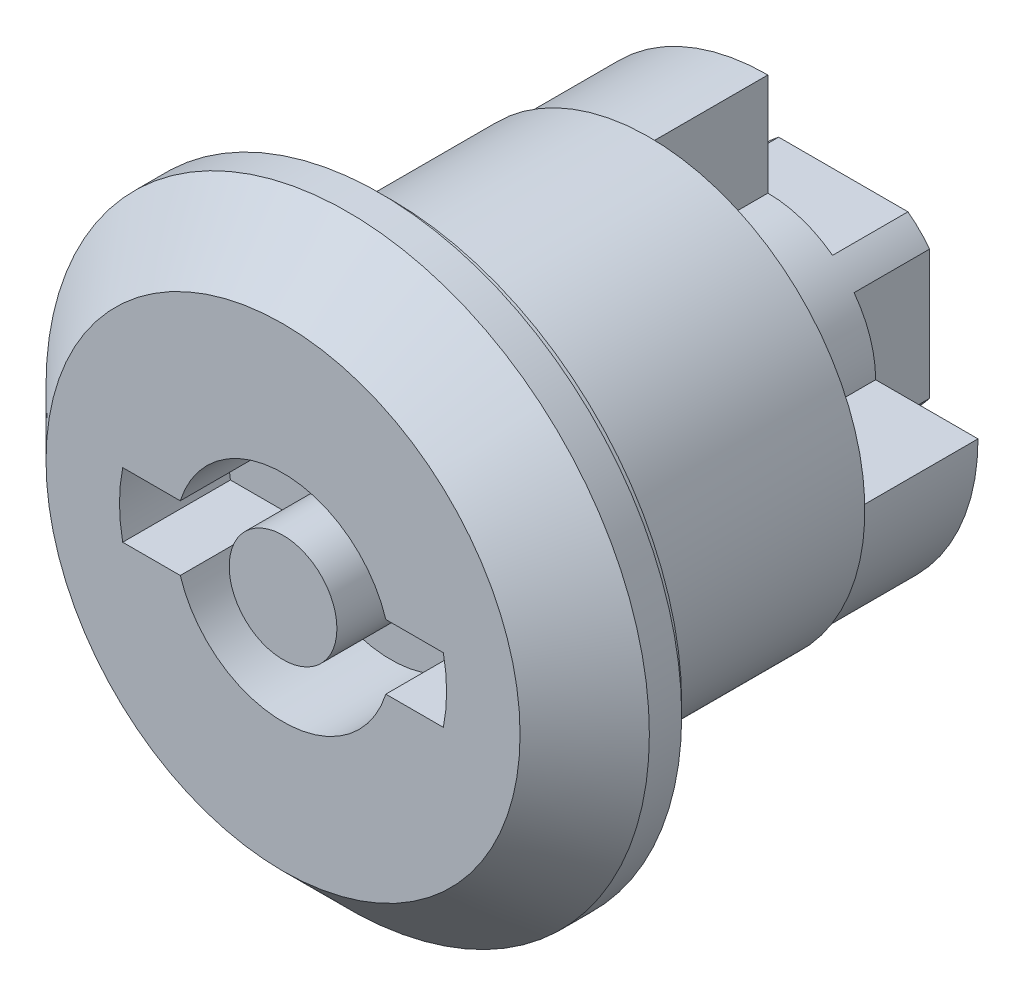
ISO-10303-21;
HEADER;
FILE_DESCRIPTION(('STEP AP214'),'2;1');
FILE_NAME('part.step','',(''),(''),'','','');
FILE_SCHEMA(('AUTOMOTIVE_DESIGN { 1 0 10303 214 1 1 1 1 }'));
ENDSEC;
DATA;
#1=APPLICATION_CONTEXT('core data for automotive mechanical design processes');
#2=APPLICATION_PROTOCOL_DEFINITION('international standard','automotive_design',2000,#1);
#3=PRODUCT_CONTEXT('',#1,'mechanical');
#4=PRODUCT('Part','Part','',(#3));
#5=PRODUCT_RELATED_PRODUCT_CATEGORY('part','',(#4));
#6=PRODUCT_DEFINITION_FORMATION('','',#4);
#7=PRODUCT_DEFINITION_CONTEXT('part definition',#1,'design');
#8=PRODUCT_DEFINITION('design','',#6,#7);
#9=PRODUCT_DEFINITION_SHAPE('','',#8);
#10=(LENGTH_UNIT() NAMED_UNIT(*) SI_UNIT(.MILLI.,.METRE.));
#11=(NAMED_UNIT(*) PLANE_ANGLE_UNIT() SI_UNIT($,.RADIAN.));
#12=(NAMED_UNIT(*) SI_UNIT($,.STERADIAN.) SOLID_ANGLE_UNIT());
#13=UNCERTAINTY_MEASURE_WITH_UNIT(LENGTH_MEASURE(1.E-05),#10,'distance_accuracy_value','');
#14=(GEOMETRIC_REPRESENTATION_CONTEXT(3) GLOBAL_UNCERTAINTY_ASSIGNED_CONTEXT((#13)) GLOBAL_UNIT_ASSIGNED_CONTEXT((#10,
#11,#12)) REPRESENTATION_CONTEXT('',''));
#15=CARTESIAN_POINT('',(0.,0.,0.));
#16=DIRECTION('',(0.,0.,1.));
#17=DIRECTION('',(1.,0.,0.));
#18=AXIS2_PLACEMENT_3D('',#15,#16,#17);
#19=CARTESIAN_POINT('',(0.,0.,-50.));
#20=DIRECTION('',(0.,0.,-1.));
#21=DIRECTION('',(-1.,0.,0.));
#22=AXIS2_PLACEMENT_3D('',#19,#20,#21);
#23=CYLINDRICAL_SURFACE('',#22,5.);
#24=CARTESIAN_POINT('',(0.,0.,-17.5));
#25=DIRECTION('',(0.,0.,-1.));
#26=DIRECTION('',(-1.,0.,0.));
#27=AXIS2_PLACEMENT_3D('',#24,#25,#26);
#28=CIRCLE('',#27,5.);
#29=CARTESIAN_POINT('',(-4.,3.,-17.5));
#30=VERTEX_POINT('',#29);
#31=CARTESIAN_POINT('',(-3.,4.,-17.5));
#32=VERTEX_POINT('',#31);
#33=EDGE_CURVE('E271',#30,#32,#28,.T.);
#34=ORIENTED_EDGE('',*,*,#33,.T.);
#35=DIRECTION('',(0.,0.,-1.));
#36=VECTOR('',#35,1.);
#37=CARTESIAN_POINT('',(-3.,4.,-11.4172374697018));
#38=LINE('',#37,#36);
#39=CARTESIAN_POINT('',(-3.,4.,-21.));
#40=VERTEX_POINT('',#39);
#41=EDGE_CURVE('E291',#32,#40,#38,.T.);
#42=ORIENTED_EDGE('',*,*,#41,.T.);
#43=CARTESIAN_POINT('',(0.,0.,-21.));
#44=DIRECTION('',(0.,0.,-1.));
#45=DIRECTION('',(-1.,0.,0.));
#46=AXIS2_PLACEMENT_3D('',#43,#44,#45);
#47=CIRCLE('',#46,5.);
#48=CARTESIAN_POINT('',(-4.,3.,-21.));
#49=VERTEX_POINT('',#48);
#50=EDGE_CURVE('E275',#49,#40,#47,.T.);
#51=ORIENTED_EDGE('',*,*,#50,.F.);
#52=DIRECTION('',(0.,0.,-1.));
#53=VECTOR('',#52,1.);
#54=CARTESIAN_POINT('',(-4.,3.,-11.4172374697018));
#55=LINE('',#54,#53);
#56=EDGE_CURVE('E288',#30,#49,#55,.T.);
#57=ORIENTED_EDGE('',*,*,#56,.F.);
#58=EDGE_LOOP('',(#34,#42,#51,#57));
#59=FACE_BOUND('',#58,.T.);
#60=ADVANCED_FACE('F14',(#59),#23,.T.);
#61=DIRECTION('',(0.,0.,-1.));
#62=VECTOR('',#61,1.);
#63=CARTESIAN_POINT('',(-3.,-4.,-11.4172374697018));
#64=LINE('',#63,#62);
#65=CARTESIAN_POINT('',(-3.,-4.,-17.5));
#66=VERTEX_POINT('',#65);
#67=CARTESIAN_POINT('',(-3.,-4.,-21.));
#68=VERTEX_POINT('',#67);
#69=EDGE_CURVE('E262',#66,#68,#64,.T.);
#70=ORIENTED_EDGE('',*,*,#69,.F.);
#71=CARTESIAN_POINT('',(-4.,-3.,-17.5));
#72=VERTEX_POINT('',#71);
#73=EDGE_CURVE('E276',#66,#72,#28,.T.);
#74=ORIENTED_EDGE('',*,*,#73,.T.);
#75=DIRECTION('',(0.,0.,-1.));
#76=VECTOR('',#75,1.);
#77=CARTESIAN_POINT('',(-4.,-3.,-11.4172374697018));
#78=LINE('',#77,#76);
#79=CARTESIAN_POINT('',(-4.,-3.,-21.));
#80=VERTEX_POINT('',#79);
#81=EDGE_CURVE('E309',#72,#80,#78,.T.);
#82=ORIENTED_EDGE('',*,*,#81,.T.);
#83=EDGE_CURVE('E272',#68,#80,#47,.T.);
#84=ORIENTED_EDGE('',*,*,#83,.F.);
#85=EDGE_LOOP('',(#70,#74,#82,#84));
#86=FACE_BOUND('',#85,.T.);
#87=ADVANCED_FACE('F220',(#86),#23,.T.);
#88=DIRECTION('',(0.,0.,-1.));
#89=VECTOR('',#88,1.);
#90=CARTESIAN_POINT('',(3.,-4.,-11.4172374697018));
#91=LINE('',#90,#89);
#92=CARTESIAN_POINT('',(3.,-4.,-17.5));
#93=VERTEX_POINT('',#92);
#94=CARTESIAN_POINT('',(3.,-4.,-21.));
#95=VERTEX_POINT('',#94);
#96=EDGE_CURVE('E254',#93,#95,#91,.T.);
#97=ORIENTED_EDGE('',*,*,#96,.T.);
#98=CARTESIAN_POINT('',(4.,-3.,-21.));
#99=VERTEX_POINT('',#98);
#100=EDGE_CURVE('E257',#99,#95,#47,.T.);
#101=ORIENTED_EDGE('',*,*,#100,.F.);
#102=DIRECTION('',(0.,0.,-1.));
#103=VECTOR('',#102,1.);
#104=CARTESIAN_POINT('',(4.,-3.,-11.4172374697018));
#105=LINE('',#104,#103);
#106=CARTESIAN_POINT('',(4.,-3.,-17.5));
#107=VERTEX_POINT('',#106);
#108=EDGE_CURVE('E313',#107,#99,#105,.T.);
#109=ORIENTED_EDGE('',*,*,#108,.F.);
#110=EDGE_CURVE('E259',#107,#93,#28,.T.);
#111=ORIENTED_EDGE('',*,*,#110,.T.);
#112=EDGE_LOOP('',(#97,#101,#109,#111));
#113=FACE_BOUND('',#112,.T.);
#114=ADVANCED_FACE('F228',(#113),#23,.T.);
#115=CARTESIAN_POINT('',(0.,5.,-21.));
#116=DIRECTION('',(0.,0.,1.));
#117=DIRECTION('',(1.,0.,0.));
#118=AXIS2_PLACEMENT_3D('',#115,#116,#117);
#119=PLANE('',#118);
#120=CARTESIAN_POINT('',(0.,0.,-21.));
#121=DIRECTION('',(0.,0.,-1.));
#122=DIRECTION('',(-1.,0.,0.));
#123=AXIS2_PLACEMENT_3D('',#120,#121,#122);
#124=CIRCLE('',#123,3.);
#125=CARTESIAN_POINT('',(-3.,0.,-21.));
#126=VERTEX_POINT('',#125);
#127=EDGE_CURVE('E441',#126,#126,#124,.T.);
#128=ORIENTED_EDGE('',*,*,#127,.F.);
#129=EDGE_LOOP('',(#128));
#130=FACE_BOUND('',#129,.T.);
#131=ORIENTED_EDGE('',*,*,#50,.T.);
#132=DIRECTION('',(-1.,0.,0.));
#133=VECTOR('',#132,1.);
#134=CARTESIAN_POINT('',(3.,4.,-21.));
#135=LINE('',#134,#133);
#136=CARTESIAN_POINT('',(3.,4.,-21.));
#137=VERTEX_POINT('',#136);
#138=EDGE_CURVE('E283',#137,#40,#135,.T.);
#139=ORIENTED_EDGE('',*,*,#138,.F.);
#140=CARTESIAN_POINT('',(4.,3.,-21.));
#141=VERTEX_POINT('',#140);
#142=EDGE_CURVE('E274',#137,#141,#47,.T.);
#143=ORIENTED_EDGE('',*,*,#142,.T.);
#144=DIRECTION('',(0.,-1.,0.));
#145=VECTOR('',#144,1.);
#146=CARTESIAN_POINT('',(4.,3.,-21.));
#147=LINE('',#146,#145);
#148=EDGE_CURVE('E270',#141,#99,#147,.T.);
#149=ORIENTED_EDGE('',*,*,#148,.T.);
#150=ORIENTED_EDGE('',*,*,#100,.T.);
#151=DIRECTION('',(-1.,0.,0.));
#152=VECTOR('',#151,1.);
#153=CARTESIAN_POINT('',(3.,-4.,-21.));
#154=LINE('',#153,#152);
#155=EDGE_CURVE('E261',#95,#68,#154,.T.);
#156=ORIENTED_EDGE('',*,*,#155,.T.);
#157=ORIENTED_EDGE('',*,*,#83,.T.);
#158=DIRECTION('',(0.,-1.,0.));
#159=VECTOR('',#158,1.);
#160=CARTESIAN_POINT('',(-4.,3.,-21.));
#161=LINE('',#160,#159);
#162=EDGE_CURVE('E285',#49,#80,#161,.T.);
#163=ORIENTED_EDGE('',*,*,#162,.F.);
#164=EDGE_LOOP('',(#131,#139,#143,#149,#150,#156,#157,#163));
#165=FACE_BOUND('',#164,.T.);
#166=ADVANCED_FACE('F234',(#130,#165),#119,.F.);
#167=ORIENTED_EDGE('',*,*,#142,.F.);
#168=DIRECTION('',(0.,0.,-1.));
#169=VECTOR('',#168,1.);
#170=CARTESIAN_POINT('',(3.,4.,-11.4172374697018));
#171=LINE('',#170,#169);
#172=CARTESIAN_POINT('',(3.,4.,-17.5));
#173=VERTEX_POINT('',#172);
#174=EDGE_CURVE('E294',#173,#137,#171,.T.);
#175=ORIENTED_EDGE('',*,*,#174,.F.);
#176=CARTESIAN_POINT('',(0.,0.,-17.5));
#177=DIRECTION('',(0.,0.,-1.));
#178=DIRECTION('',(-1.,0.,0.));
#179=AXIS2_PLACEMENT_3D('',#176,#177,#178);
#180=CIRCLE('',#179,5.);
#181=CARTESIAN_POINT('',(0.,5.,-17.5));
#182=VERTEX_POINT('',#181);
#183=EDGE_CURVE('E451',#182,#173,#180,.T.);
#184=ORIENTED_EDGE('',*,*,#183,.F.);
#185=DIRECTION('',(0.,0.,-1.));
#186=VECTOR('',#185,1.);
#187=CARTESIAN_POINT('',(0.,5.,1.78858223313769));
#188=LINE('',#187,#186);
#189=CARTESIAN_POINT('',(0.,5.,-12.));
#190=VERTEX_POINT('',#189);
#191=EDGE_CURVE('E465',#190,#182,#188,.T.);
#192=ORIENTED_EDGE('',*,*,#191,.F.);
#193=CARTESIAN_POINT('',(0.,0.,-12.));
#194=DIRECTION('',(0.,0.,1.));
#195=DIRECTION('',(1.,0.,0.));
#196=AXIS2_PLACEMENT_3D('',#193,#194,#195);
#197=CIRCLE('',#196,5.);
#198=CARTESIAN_POINT('',(5.,0.,-12.));
#199=VERTEX_POINT('',#198);
#200=EDGE_CURVE('E449',#190,#199,#197,.F.);
#201=ORIENTED_EDGE('',*,*,#200,.T.);
#202=DIRECTION('',(0.,0.,-1.));
#203=VECTOR('',#202,1.);
#204=CARTESIAN_POINT('',(5.,0.,1.78858223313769));
#205=LINE('',#204,#203);
#206=CARTESIAN_POINT('',(5.,0.,-17.5));
#207=VERTEX_POINT('',#206);
#208=EDGE_CURVE('E453',#199,#207,#205,.T.);
#209=ORIENTED_EDGE('',*,*,#208,.T.);
#210=CARTESIAN_POINT('',(4.,3.,-17.5));
#211=VERTEX_POINT('',#210);
#212=EDGE_CURVE('E454',#211,#207,#180,.T.);
#213=ORIENTED_EDGE('',*,*,#212,.F.);
#214=DIRECTION('',(0.,0.,-1.));
#215=VECTOR('',#214,1.);
#216=CARTESIAN_POINT('',(4.,3.,-11.4172374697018));
#217=LINE('',#216,#215);
#218=EDGE_CURVE('E316',#211,#141,#217,.T.);
#219=ORIENTED_EDGE('',*,*,#218,.T.);
#220=EDGE_LOOP('',(#167,#175,#184,#192,#201,#209,#213,#219));
#221=FACE_BOUND('',#220,.T.);
#222=ADVANCED_FACE('F223',(#221),#23,.T.);
#223=CARTESIAN_POINT('',(0.,0.,-50.));
#224=DIRECTION('',(0.,0.,-1.));
#225=DIRECTION('',(-1.,0.,0.));
#226=AXIS2_PLACEMENT_3D('',#223,#224,#225);
#227=CYLINDRICAL_SURFACE('',#226,10.);
#228=CARTESIAN_POINT('',(0.,0.,-12.));
#229=DIRECTION('',(0.,0.,-1.));
#230=DIRECTION('',(-1.,0.,0.));
#231=AXIS2_PLACEMENT_3D('',#228,#229,#230);
#232=CIRCLE('',#231,10.);
#233=CARTESIAN_POINT('',(-10.,0.,-12.));
#234=VERTEX_POINT('',#233);
#235=EDGE_CURVE('E9',#234,#234,#232,.T.);
#236=ORIENTED_EDGE('',*,*,#235,.F.);
#237=EDGE_LOOP('',(#236));
#238=FACE_BOUND('',#237,.T.);
#239=CARTESIAN_POINT('',(0.,0.,0.));
#240=DIRECTION('',(0.,0.,-1.));
#241=DIRECTION('',(-1.,0.,0.));
#242=AXIS2_PLACEMENT_3D('',#239,#240,#241);
#243=CIRCLE('',#242,10.);
#244=CARTESIAN_POINT('',(-10.,0.,0.));
#245=VERTEX_POINT('',#244);
#246=EDGE_CURVE('E318',#245,#245,#243,.T.);
#247=ORIENTED_EDGE('',*,*,#246,.T.);
#248=EDGE_LOOP('',(#247));
#249=FACE_BOUND('',#248,.T.);
#250=ADVANCED_FACE('F16',(#238,#249),#227,.T.);
#251=CARTESIAN_POINT('',(0.,10.,-12.));
#252=DIRECTION('',(0.,0.,1.));
#253=DIRECTION('',(1.,0.,0.));
#254=AXIS2_PLACEMENT_3D('',#251,#252,#253);
#255=PLANE('',#254);
#256=CARTESIAN_POINT('',(0.,0.,-12.));
#257=DIRECTION('',(0.,0.,-1.));
#258=DIRECTION('',(-1.,0.,0.));
#259=AXIS2_PLACEMENT_3D('',#256,#257,#258);
#260=CIRCLE('',#259,9.75);
#261=CARTESIAN_POINT('',(9.75,0.,-12.));
#262=VERTEX_POINT('',#261);
#263=CARTESIAN_POINT('',(0.,9.75,-12.));
#264=VERTEX_POINT('',#263);
#265=EDGE_CURVE('E22',#262,#264,#260,.T.);
#266=ORIENTED_EDGE('',*,*,#265,.F.);
#267=DIRECTION('',(1.,0.,0.));
#268=VECTOR('',#267,1.);
#269=CARTESIAN_POINT('',(5.,0.,-12.));
#270=LINE('',#269,#268);
#271=EDGE_CURVE('E458',#199,#262,#270,.T.);
#272=ORIENTED_EDGE('',*,*,#271,.F.);
#273=ORIENTED_EDGE('',*,*,#200,.F.);
#274=DIRECTION('',(0.,1.,0.));
#275=VECTOR('',#274,1.);
#276=CARTESIAN_POINT('',(0.,5.,-12.));
#277=LINE('',#276,#275);
#278=EDGE_CURVE('E459',#190,#264,#277,.T.);
#279=ORIENTED_EDGE('',*,*,#278,.T.);
#280=EDGE_LOOP('',(#266,#272,#273,#279));
#281=FACE_BOUND('',#280,.T.);
#282=ORIENTED_EDGE('',*,*,#235,.T.);
#283=EDGE_LOOP('',(#282));
#284=FACE_BOUND('',#283,.T.);
#285=ADVANCED_FACE('F241',(#281,#284),#255,.F.);
#286=CARTESIAN_POINT('',(0.,0.,-50.));
#287=DIRECTION('',(0.,0.,-1.));
#288=DIRECTION('',(-1.,0.,0.));
#289=AXIS2_PLACEMENT_3D('',#286,#287,#288);
#290=CYLINDRICAL_SURFACE('',#289,9.75);
#291=ORIENTED_EDGE('',*,*,#265,.T.);
#292=DIRECTION('',(0.,0.,-1.));
#293=VECTOR('',#292,1.);
#294=CARTESIAN_POINT('',(0.,9.75,1.78858223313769));
#295=LINE('',#294,#293);
#296=CARTESIAN_POINT('',(0.,9.75,-17.5));
#297=VERTEX_POINT('',#296);
#298=EDGE_CURVE('E461',#264,#297,#295,.T.);
#299=ORIENTED_EDGE('',*,*,#298,.T.);
#300=CARTESIAN_POINT('',(0.,0.,-17.5));
#301=DIRECTION('',(0.,0.,-1.));
#302=DIRECTION('',(-1.,0.,0.));
#303=AXIS2_PLACEMENT_3D('',#300,#301,#302);
#304=CIRCLE('',#303,9.75);
#305=CARTESIAN_POINT('',(9.75,0.,-17.5));
#306=VERTEX_POINT('',#305);
#307=EDGE_CURVE('E477',#306,#297,#304,.T.);
#308=ORIENTED_EDGE('',*,*,#307,.F.);
#309=DIRECTION('',(0.,0.,-1.));
#310=VECTOR('',#309,1.);
#311=CARTESIAN_POINT('',(9.75,0.,1.78858223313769));
#312=LINE('',#311,#310);
#313=EDGE_CURVE('E37',#262,#306,#312,.T.);
#314=ORIENTED_EDGE('',*,*,#313,.F.);
#315=EDGE_LOOP('',(#291,#299,#308,#314));
#316=FACE_BOUND('',#315,.T.);
#317=ADVANCED_FACE('F349',(#316),#290,.T.);
#318=CARTESIAN_POINT('',(0.,9.75,-17.5));
#319=DIRECTION('',(0.,0.,1.));
#320=DIRECTION('',(1.,0.,0.));
#321=AXIS2_PLACEMENT_3D('',#318,#319,#320);
#322=PLANE('',#321);
#323=ORIENTED_EDGE('',*,*,#307,.T.);
#324=DIRECTION('',(0.,1.,0.));
#325=VECTOR('',#324,1.);
#326=CARTESIAN_POINT('',(0.,5.,-17.5));
#327=LINE('',#326,#325);
#328=EDGE_CURVE('E447',#182,#297,#327,.T.);
#329=ORIENTED_EDGE('',*,*,#328,.F.);
#330=ORIENTED_EDGE('',*,*,#183,.T.);
#331=DIRECTION('',(-1.,0.,0.));
#332=VECTOR('',#331,1.);
#333=CARTESIAN_POINT('',(3.,4.,-17.5));
#334=LINE('',#333,#332);
#335=EDGE_CURVE('E295',#173,#32,#334,.T.);
#336=ORIENTED_EDGE('',*,*,#335,.T.);
#337=ORIENTED_EDGE('',*,*,#33,.F.);
#338=DIRECTION('',(0.,-1.,0.));
#339=VECTOR('',#338,1.);
#340=CARTESIAN_POINT('',(-4.,3.,-17.5));
#341=LINE('',#340,#339);
#342=EDGE_CURVE('E306',#30,#72,#341,.T.);
#343=ORIENTED_EDGE('',*,*,#342,.T.);
#344=ORIENTED_EDGE('',*,*,#73,.F.);
#345=DIRECTION('',(-1.,0.,0.));
#346=VECTOR('',#345,1.);
#347=CARTESIAN_POINT('',(3.,-4.,-17.5));
#348=LINE('',#347,#346);
#349=EDGE_CURVE('E302',#93,#66,#348,.T.);
#350=ORIENTED_EDGE('',*,*,#349,.F.);
#351=ORIENTED_EDGE('',*,*,#110,.F.);
#352=DIRECTION('',(0.,-1.,0.));
#353=VECTOR('',#352,1.);
#354=CARTESIAN_POINT('',(4.,3.,-17.5));
#355=LINE('',#354,#353);
#356=EDGE_CURVE('E315',#211,#107,#355,.T.);
#357=ORIENTED_EDGE('',*,*,#356,.F.);
#358=ORIENTED_EDGE('',*,*,#212,.T.);
#359=DIRECTION('',(1.,0.,0.));
#360=VECTOR('',#359,1.);
#361=CARTESIAN_POINT('',(5.,0.,-17.5));
#362=LINE('',#361,#360);
#363=EDGE_CURVE('E450',#207,#306,#362,.T.);
#364=ORIENTED_EDGE('',*,*,#363,.T.);
#365=EDGE_LOOP('',(#323,#329,#330,#336,#337,#343,#344,#350,#351,#357,#358,#364));
#366=FACE_BOUND('',#365,.T.);
#367=ADVANCED_FACE('F340',(#366),#322,.F.);
#368=CARTESIAN_POINT('',(0.,11.,5.));
#369=DIRECTION('',(0.,0.,1.));
#370=DIRECTION('',(1.,0.,0.));
#371=AXIS2_PLACEMENT_3D('',#368,#369,#370);
#372=PLANE('',#371);
#373=CARTESIAN_POINT('',(0.,0.,5.));
#374=DIRECTION('',(0.,0.,1.));
#375=DIRECTION('',(1.,0.,0.));
#376=AXIS2_PLACEMENT_3D('',#373,#374,#375);
#377=CIRCLE('',#376,7.59);
#378=CARTESIAN_POINT('',(-7.44030241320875,1.5,5.));
#379=VERTEX_POINT('',#378);
#380=CARTESIAN_POINT('',(-7.44030241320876,-1.5,5.));
#381=VERTEX_POINT('',#380);
#382=EDGE_CURVE('E29',#379,#381,#377,.T.);
#383=ORIENTED_EDGE('',*,*,#382,.F.);
#384=DIRECTION('',(1.,0.,0.));
#385=VECTOR('',#384,1.);
#386=CARTESIAN_POINT('',(-7.44030241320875,1.5,5.));
#387=LINE('',#386,#385);
#388=CARTESIAN_POINT('',(-4.76969600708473,1.5,5.));
#389=VERTEX_POINT('',#388);
#390=EDGE_CURVE('E183',#379,#389,#387,.T.);
#391=ORIENTED_EDGE('',*,*,#390,.T.);
#392=CARTESIAN_POINT('',(0.,0.,5.));
#393=DIRECTION('',(0.,0.,1.));
#394=DIRECTION('',(1.,0.,0.));
#395=AXIS2_PLACEMENT_3D('',#392,#393,#394);
#396=CIRCLE('',#395,5.);
#397=CARTESIAN_POINT('',(4.76969600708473,1.5,5.));
#398=VERTEX_POINT('',#397);
#399=EDGE_CURVE('E177',#398,#389,#396,.T.);
#400=ORIENTED_EDGE('',*,*,#399,.F.);
#401=DIRECTION('',(1.,0.,0.));
#402=VECTOR('',#401,1.);
#403=CARTESIAN_POINT('',(4.76969600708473,1.5,5.));
#404=LINE('',#403,#402);
#405=CARTESIAN_POINT('',(7.44030241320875,1.5,5.));
#406=VERTEX_POINT('',#405);
#407=EDGE_CURVE('E184',#398,#406,#404,.T.);
#408=ORIENTED_EDGE('',*,*,#407,.T.);
#409=CARTESIAN_POINT('',(7.44030241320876,-1.5,5.));
#410=VERTEX_POINT('',#409);
#411=EDGE_CURVE('E178',#410,#406,#377,.T.);
#412=ORIENTED_EDGE('',*,*,#411,.F.);
#413=DIRECTION('',(-1.,0.,0.));
#414=VECTOR('',#413,1.);
#415=CARTESIAN_POINT('',(7.44030241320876,-1.5,5.));
#416=LINE('',#415,#414);
#417=CARTESIAN_POINT('',(4.76969600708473,-1.5,5.));
#418=VERTEX_POINT('',#417);
#419=EDGE_CURVE('E175',#410,#418,#416,.T.);
#420=ORIENTED_EDGE('',*,*,#419,.T.);
#421=CARTESIAN_POINT('',(-4.76969600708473,-1.5,5.));
#422=VERTEX_POINT('',#421);
#423=EDGE_CURVE('E156',#422,#418,#396,.T.);
#424=ORIENTED_EDGE('',*,*,#423,.F.);
#425=DIRECTION('',(-1.,0.,0.));
#426=VECTOR('',#425,1.);
#427=CARTESIAN_POINT('',(-4.76969600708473,-1.5,5.));
#428=LINE('',#427,#426);
#429=EDGE_CURVE('E167',#422,#381,#428,.T.);
#430=ORIENTED_EDGE('',*,*,#429,.T.);
#431=EDGE_LOOP('',(#383,#391,#400,#408,#412,#420,#424,#430));
#432=FACE_BOUND('',#431,.T.);
#433=CARTESIAN_POINT('',(0.,0.,5.));
#434=DIRECTION('',(0.,0.,-1.));
#435=DIRECTION('',(-1.,0.,0.));
#436=AXIS2_PLACEMENT_3D('',#433,#434,#435);
#437=CIRCLE('',#436,11.);
#438=CARTESIAN_POINT('',(-11.,0.,5.));
#439=VERTEX_POINT('',#438);
#440=EDGE_CURVE('E279',#439,#439,#437,.T.);
#441=ORIENTED_EDGE('',*,*,#440,.F.);
#442=EDGE_LOOP('',(#441));
#443=FACE_BOUND('',#442,.T.);
#444=ADVANCED_FACE('F171',(#432,#443),#372,.T.);
#445=CARTESIAN_POINT('',(0.,0.,5.));
#446=DIRECTION('',(0.,0.,-1.));
#447=DIRECTION('',(-1.,0.,0.));
#448=AXIS2_PLACEMENT_3D('',#445,#446,#447);
#449=CONICAL_SURFACE('',#448,11.,0.785398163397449);
#450=CARTESIAN_POINT('',(0.,0.,2.));
#451=DIRECTION('',(0.,0.,-1.));
#452=DIRECTION('',(-1.,0.,0.));
#453=AXIS2_PLACEMENT_3D('',#450,#451,#452);
#454=CIRCLE('',#453,14.);
#455=CARTESIAN_POINT('',(-14.,0.,2.));
#456=VERTEX_POINT('',#455);
#457=EDGE_CURVE('E333',#456,#456,#454,.T.);
#458=ORIENTED_EDGE('',*,*,#457,.F.);
#459=EDGE_LOOP('',(#458));
#460=FACE_BOUND('',#459,.T.);
#461=ORIENTED_EDGE('',*,*,#440,.T.);
#462=EDGE_LOOP('',(#461));
#463=FACE_BOUND('',#462,.T.);
#464=ADVANCED_FACE('F338',(#460,#463),#449,.T.);
#465=CARTESIAN_POINT('',(0.,0.,-50.));
#466=DIRECTION('',(0.,0.,-1.));
#467=DIRECTION('',(-1.,0.,0.));
#468=AXIS2_PLACEMENT_3D('',#465,#466,#467);
#469=CYLINDRICAL_SURFACE('',#468,14.);
#470=CARTESIAN_POINT('',(0.,0.,0.500000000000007));
#471=DIRECTION('',(0.,0.,-1.));
#472=DIRECTION('',(-1.,0.,0.));
#473=AXIS2_PLACEMENT_3D('',#470,#471,#472);
#474=CIRCLE('',#473,14.);
#475=CARTESIAN_POINT('',(-14.,0.,0.500000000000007));
#476=VERTEX_POINT('',#475);
#477=EDGE_CURVE('E330',#476,#476,#474,.T.);
#478=ORIENTED_EDGE('',*,*,#477,.F.);
#479=EDGE_LOOP('',(#478));
#480=FACE_BOUND('',#479,.T.);
#481=ORIENTED_EDGE('',*,*,#457,.T.);
#482=EDGE_LOOP('',(#481));
#483=FACE_BOUND('',#482,.T.);
#484=ADVANCED_FACE('F346',(#480,#483),#469,.T.);
#485=CARTESIAN_POINT('',(0.,14.,0.50000000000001));
#486=DIRECTION('',(0.,0.,1.));
#487=DIRECTION('',(1.,0.,0.));
#488=AXIS2_PLACEMENT_3D('',#485,#486,#487);
#489=PLANE('',#488);
#490=CARTESIAN_POINT('',(0.,0.,0.500000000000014));
#491=DIRECTION('',(0.,0.,-1.));
#492=DIRECTION('',(-1.,0.,0.));
#493=AXIS2_PLACEMENT_3D('',#490,#491,#492);
#494=CIRCLE('',#493,13.5);
#495=CARTESIAN_POINT('',(-13.5,0.,0.500000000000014));
#496=VERTEX_POINT('',#495);
#497=EDGE_CURVE('E327',#496,#496,#494,.T.);
#498=ORIENTED_EDGE('',*,*,#497,.F.);
#499=EDGE_LOOP('',(#498));
#500=FACE_BOUND('',#499,.T.);
#501=ORIENTED_EDGE('',*,*,#477,.T.);
#502=EDGE_LOOP('',(#501));
#503=FACE_BOUND('',#502,.T.);
#504=ADVANCED_FACE('F354',(#500,#503),#489,.F.);
#505=CARTESIAN_POINT('',(0.,0.,-50.));
#506=DIRECTION('',(0.,0.,-1.));
#507=DIRECTION('',(-1.,0.,0.));
#508=AXIS2_PLACEMENT_3D('',#505,#506,#507);
#509=CYLINDRICAL_SURFACE('',#508,13.5);
#510=ORIENTED_EDGE('',*,*,#497,.T.);
#511=EDGE_LOOP('',(#510));
#512=FACE_BOUND('',#511,.T.);
#513=CARTESIAN_POINT('',(0.,0.,0.));
#514=DIRECTION('',(0.,0.,-1.));
#515=DIRECTION('',(-1.,0.,0.));
#516=AXIS2_PLACEMENT_3D('',#513,#514,#515);
#517=CIRCLE('',#516,13.5);
#518=CARTESIAN_POINT('',(-13.5,0.,0.));
#519=VERTEX_POINT('',#518);
#520=EDGE_CURVE('E324',#519,#519,#517,.T.);
#521=ORIENTED_EDGE('',*,*,#520,.F.);
#522=EDGE_LOOP('',(#521));
#523=FACE_BOUND('',#522,.T.);
#524=ADVANCED_FACE('F358',(#512,#523),#509,.T.);
#525=CARTESIAN_POINT('',(0.,13.5,0.));
#526=DIRECTION('',(0.,0.,1.));
#527=DIRECTION('',(1.,0.,0.));
#528=AXIS2_PLACEMENT_3D('',#525,#526,#527);
#529=PLANE('',#528);
#530=ORIENTED_EDGE('',*,*,#246,.F.);
#531=EDGE_LOOP('',(#530));
#532=FACE_BOUND('',#531,.T.);
#533=ORIENTED_EDGE('',*,*,#520,.T.);
#534=EDGE_LOOP('',(#533));
#535=FACE_BOUND('',#534,.T.);
#536=ADVANCED_FACE('F362',(#532,#535),#529,.F.);
#537=CARTESIAN_POINT('',(4.,3.,-11.4172374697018));
#538=DIRECTION('',(1.,0.,0.));
#539=DIRECTION('',(0.,0.,-1.));
#540=AXIS2_PLACEMENT_3D('',#537,#538,#539);
#541=PLANE('',#540);
#542=ORIENTED_EDGE('',*,*,#356,.T.);
#543=ORIENTED_EDGE('',*,*,#108,.T.);
#544=ORIENTED_EDGE('',*,*,#148,.F.);
#545=ORIENTED_EDGE('',*,*,#218,.F.);
#546=EDGE_LOOP('',(#542,#543,#544,#545));
#547=FACE_BOUND('',#546,.T.);
#548=ADVANCED_FACE('F366',(#547),#541,.T.);
#549=CARTESIAN_POINT('',(-4.,3.,-11.4172374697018));
#550=DIRECTION('',(1.,0.,0.));
#551=DIRECTION('',(0.,0.,-1.));
#552=AXIS2_PLACEMENT_3D('',#549,#550,#551);
#553=PLANE('',#552);
#554=ORIENTED_EDGE('',*,*,#56,.T.);
#555=ORIENTED_EDGE('',*,*,#162,.T.);
#556=ORIENTED_EDGE('',*,*,#81,.F.);
#557=ORIENTED_EDGE('',*,*,#342,.F.);
#558=EDGE_LOOP('',(#554,#555,#556,#557));
#559=FACE_BOUND('',#558,.T.);
#560=ADVANCED_FACE('F370',(#559),#553,.F.);
#561=CARTESIAN_POINT('',(3.,-4.,-11.4172374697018));
#562=DIRECTION('',(0.,-1.,0.));
#563=DIRECTION('',(1.,0.,0.));
#564=AXIS2_PLACEMENT_3D('',#561,#562,#563);
#565=PLANE('',#564);
#566=ORIENTED_EDGE('',*,*,#349,.T.);
#567=ORIENTED_EDGE('',*,*,#69,.T.);
#568=ORIENTED_EDGE('',*,*,#155,.F.);
#569=ORIENTED_EDGE('',*,*,#96,.F.);
#570=EDGE_LOOP('',(#566,#567,#568,#569));
#571=FACE_BOUND('',#570,.T.);
#572=ADVANCED_FACE('F374',(#571),#565,.T.);
#573=CARTESIAN_POINT('',(3.,4.,-11.4172374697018));
#574=DIRECTION('',(0.,-1.,0.));
#575=DIRECTION('',(1.,0.,0.));
#576=AXIS2_PLACEMENT_3D('',#573,#574,#575);
#577=PLANE('',#576);
#578=ORIENTED_EDGE('',*,*,#174,.T.);
#579=ORIENTED_EDGE('',*,*,#138,.T.);
#580=ORIENTED_EDGE('',*,*,#41,.F.);
#581=ORIENTED_EDGE('',*,*,#335,.F.);
#582=EDGE_LOOP('',(#578,#579,#580,#581));
#583=FACE_BOUND('',#582,.T.);
#584=ADVANCED_FACE('F378',(#583),#577,.F.);
#585=CARTESIAN_POINT('',(0.,5.,1.78858223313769));
#586=DIRECTION('',(-1.,0.,0.));
#587=DIRECTION('',(0.,0.,1.));
#588=AXIS2_PLACEMENT_3D('',#585,#586,#587);
#589=PLANE('',#588);
#590=ORIENTED_EDGE('',*,*,#191,.T.);
#591=ORIENTED_EDGE('',*,*,#328,.T.);
#592=ORIENTED_EDGE('',*,*,#298,.F.);
#593=ORIENTED_EDGE('',*,*,#278,.F.);
#594=EDGE_LOOP('',(#590,#591,#592,#593));
#595=FACE_BOUND('',#594,.T.);
#596=ADVANCED_FACE('F381',(#595),#589,.F.);
#597=CARTESIAN_POINT('',(5.,0.,1.78858223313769));
#598=DIRECTION('',(0.,1.,0.));
#599=DIRECTION('',(-1.,0.,0.));
#600=AXIS2_PLACEMENT_3D('',#597,#598,#599);
#601=PLANE('',#600);
#602=ORIENTED_EDGE('',*,*,#271,.T.);
#603=ORIENTED_EDGE('',*,*,#313,.T.);
#604=ORIENTED_EDGE('',*,*,#363,.F.);
#605=ORIENTED_EDGE('',*,*,#208,.F.);
#606=EDGE_LOOP('',(#602,#603,#604,#605));
#607=FACE_BOUND('',#606,.T.);
#608=ADVANCED_FACE('F384',(#607),#601,.T.);
#609=CARTESIAN_POINT('',(0.,0.,-11.));
#610=DIRECTION('',(0.,0.,-1.));
#611=DIRECTION('',(-1.,0.,0.));
#612=AXIS2_PLACEMENT_3D('',#609,#610,#611);
#613=CYLINDRICAL_SURFACE('',#612,3.);
#614=CARTESIAN_POINT('',(0.,0.,-11.));
#615=DIRECTION('',(0.,0.,-1.));
#616=DIRECTION('',(-1.,0.,0.));
#617=AXIS2_PLACEMENT_3D('',#614,#615,#616);
#618=CIRCLE('',#617,3.);
#619=CARTESIAN_POINT('',(-3.,0.,-11.));
#620=VERTEX_POINT('',#619);
#621=EDGE_CURVE('E444',#620,#620,#618,.T.);
#622=ORIENTED_EDGE('',*,*,#621,.F.);
#623=EDGE_LOOP('',(#622));
#624=FACE_BOUND('',#623,.T.);
#625=ORIENTED_EDGE('',*,*,#127,.T.);
#626=EDGE_LOOP('',(#625));
#627=FACE_BOUND('',#626,.T.);
#628=ADVANCED_FACE('F388',(#624,#627),#613,.F.);
#629=CARTESIAN_POINT('',(0.,0.,-11.));
#630=DIRECTION('',(0.,0.,-1.));
#631=DIRECTION('',(-1.,0.,0.));
#632=AXIS2_PLACEMENT_3D('',#629,#630,#631);
#633=PLANE('',#632);
#634=ORIENTED_EDGE('',*,*,#621,.T.);
#635=EDGE_LOOP('',(#634));
#636=FACE_BOUND('',#635,.T.);
#637=ADVANCED_FACE('F389',(#636),#633,.T.);
#638=CARTESIAN_POINT('',(0.,0.,0.));
#639=DIRECTION('',(0.,0.,1.));
#640=DIRECTION('',(1.,0.,0.));
#641=AXIS2_PLACEMENT_3D('',#638,#639,#640);
#642=CYLINDRICAL_SURFACE('',#641,7.59);
#643=DIRECTION('',(0.,0.,1.));
#644=VECTOR('',#643,1.);
#645=CARTESIAN_POINT('',(-7.44030241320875,1.5,0.));
#646=LINE('',#645,#644);
#647=CARTESIAN_POINT('',(-7.44030241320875,1.5,0.));
#648=VERTEX_POINT('',#647);
#649=EDGE_CURVE('E439',#648,#379,#646,.T.);
#650=ORIENTED_EDGE('',*,*,#649,.T.);
#651=ORIENTED_EDGE('',*,*,#382,.T.);
#652=DIRECTION('',(0.,0.,1.));
#653=VECTOR('',#652,1.);
#654=CARTESIAN_POINT('',(-7.44030241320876,-1.5,0.));
#655=LINE('',#654,#653);
#656=CARTESIAN_POINT('',(-7.44030241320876,-1.5,0.));
#657=VERTEX_POINT('',#656);
#658=EDGE_CURVE('E164',#657,#381,#655,.T.);
#659=ORIENTED_EDGE('',*,*,#658,.F.);
#660=CARTESIAN_POINT('',(0.,0.,0.));
#661=DIRECTION('',(0.,0.,1.));
#662=DIRECTION('',(1.,0.,0.));
#663=AXIS2_PLACEMENT_3D('',#660,#661,#662);
#664=CIRCLE('',#663,7.59);
#665=EDGE_CURVE('E188',#648,#657,#664,.T.);
#666=ORIENTED_EDGE('',*,*,#665,.F.);
#667=EDGE_LOOP('',(#650,#651,#659,#666));
#668=FACE_BOUND('',#667,.T.);
#669=ADVANCED_FACE('F393',(#668),#642,.F.);
#670=CARTESIAN_POINT('',(-7.44030241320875,1.5,0.));
#671=DIRECTION('',(0.,-1.,0.));
#672=DIRECTION('',(1.,0.,0.));
#673=AXIS2_PLACEMENT_3D('',#670,#671,#672);
#674=PLANE('',#673);
#675=DIRECTION('',(0.,0.,1.));
#676=VECTOR('',#675,1.);
#677=CARTESIAN_POINT('',(-4.76969600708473,1.5,0.));
#678=LINE('',#677,#676);
#679=CARTESIAN_POINT('',(-4.76969600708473,1.5,0.));
#680=VERTEX_POINT('',#679);
#681=EDGE_CURVE('E437',#680,#389,#678,.T.);
#682=ORIENTED_EDGE('',*,*,#681,.T.);
#683=ORIENTED_EDGE('',*,*,#390,.F.);
#684=ORIENTED_EDGE('',*,*,#649,.F.);
#685=DIRECTION('',(1.,0.,0.));
#686=VECTOR('',#685,1.);
#687=CARTESIAN_POINT('',(-7.44030241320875,1.5,0.));
#688=LINE('',#687,#686);
#689=EDGE_CURVE('E697',#648,#680,#688,.T.);
#690=ORIENTED_EDGE('',*,*,#689,.T.);
#691=EDGE_LOOP('',(#682,#683,#684,#690));
#692=FACE_BOUND('',#691,.T.);
#693=ADVANCED_FACE('F397',(#692),#674,.T.);
#694=CARTESIAN_POINT('',(0.,0.,0.));
#695=DIRECTION('',(0.,0.,1.));
#696=DIRECTION('',(1.,0.,0.));
#697=AXIS2_PLACEMENT_3D('',#694,#695,#696);
#698=CYLINDRICAL_SURFACE('',#697,5.);
#699=DIRECTION('',(0.,0.,1.));
#700=VECTOR('',#699,1.);
#701=CARTESIAN_POINT('',(4.76969600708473,1.5,0.));
#702=LINE('',#701,#700);
#703=CARTESIAN_POINT('',(4.76969600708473,1.5,0.));
#704=VERTEX_POINT('',#703);
#705=EDGE_CURVE('E435',#704,#398,#702,.T.);
#706=ORIENTED_EDGE('',*,*,#705,.T.);
#707=ORIENTED_EDGE('',*,*,#399,.T.);
#708=ORIENTED_EDGE('',*,*,#681,.F.);
#709=CARTESIAN_POINT('',(0.,0.,0.));
#710=DIRECTION('',(0.,0.,1.));
#711=DIRECTION('',(1.,0.,0.));
#712=AXIS2_PLACEMENT_3D('',#709,#710,#711);
#713=CIRCLE('',#712,5.);
#714=EDGE_CURVE('E690',#704,#680,#713,.T.);
#715=ORIENTED_EDGE('',*,*,#714,.F.);
#716=EDGE_LOOP('',(#706,#707,#708,#715));
#717=FACE_BOUND('',#716,.T.);
#718=ADVANCED_FACE('F400',(#717),#698,.F.);
#719=CARTESIAN_POINT('',(4.76969600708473,1.5,0.));
#720=DIRECTION('',(0.,-1.,0.));
#721=DIRECTION('',(1.,0.,0.));
#722=AXIS2_PLACEMENT_3D('',#719,#720,#721);
#723=PLANE('',#722);
#724=DIRECTION('',(0.,0.,1.));
#725=VECTOR('',#724,1.);
#726=CARTESIAN_POINT('',(7.44030241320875,1.5,0.));
#727=LINE('',#726,#725);
#728=CARTESIAN_POINT('',(7.44030241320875,1.5,0.));
#729=VERTEX_POINT('',#728);
#730=EDGE_CURVE('E428',#729,#406,#727,.T.);
#731=ORIENTED_EDGE('',*,*,#730,.T.);
#732=ORIENTED_EDGE('',*,*,#407,.F.);
#733=ORIENTED_EDGE('',*,*,#705,.F.);
#734=DIRECTION('',(1.,0.,0.));
#735=VECTOR('',#734,1.);
#736=CARTESIAN_POINT('',(4.76969600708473,1.5,0.));
#737=LINE('',#736,#735);
#738=EDGE_CURVE('E700',#704,#729,#737,.T.);
#739=ORIENTED_EDGE('',*,*,#738,.T.);
#740=EDGE_LOOP('',(#731,#732,#733,#739));
#741=FACE_BOUND('',#740,.T.);
#742=ADVANCED_FACE('F402',(#741),#723,.T.);
#743=DIRECTION('',(0.,0.,1.));
#744=VECTOR('',#743,1.);
#745=CARTESIAN_POINT('',(7.44030241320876,-1.5,0.));
#746=LINE('',#745,#744);
#747=CARTESIAN_POINT('',(7.44030241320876,-1.5,0.));
#748=VERTEX_POINT('',#747);
#749=EDGE_CURVE('E423',#748,#410,#746,.T.);
#750=ORIENTED_EDGE('',*,*,#749,.T.);
#751=ORIENTED_EDGE('',*,*,#411,.T.);
#752=ORIENTED_EDGE('',*,*,#730,.F.);
#753=EDGE_CURVE('E425',#748,#729,#664,.T.);
#754=ORIENTED_EDGE('',*,*,#753,.F.);
#755=EDGE_LOOP('',(#750,#751,#752,#754));
#756=FACE_BOUND('',#755,.T.);
#757=ADVANCED_FACE('F405',(#756),#642,.F.);
#758=CARTESIAN_POINT('',(7.44030241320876,-1.5,0.));
#759=DIRECTION('',(0.,1.,0.));
#760=DIRECTION('',(-1.,0.,0.));
#761=AXIS2_PLACEMENT_3D('',#758,#759,#760);
#762=PLANE('',#761);
#763=DIRECTION('',(0.,0.,1.));
#764=VECTOR('',#763,1.);
#765=CARTESIAN_POINT('',(4.76969600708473,-1.5,0.));
#766=LINE('',#765,#764);
#767=CARTESIAN_POINT('',(4.76969600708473,-1.5,0.));
#768=VERTEX_POINT('',#767);
#769=EDGE_CURVE('E163',#768,#418,#766,.T.);
#770=ORIENTED_EDGE('',*,*,#769,.T.);
#771=ORIENTED_EDGE('',*,*,#419,.F.);
#772=ORIENTED_EDGE('',*,*,#749,.F.);
#773=DIRECTION('',(-1.,0.,0.));
#774=VECTOR('',#773,1.);
#775=CARTESIAN_POINT('',(7.44030241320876,-1.5,0.));
#776=LINE('',#775,#774);
#777=EDGE_CURVE('E430',#748,#768,#776,.T.);
#778=ORIENTED_EDGE('',*,*,#777,.T.);
#779=EDGE_LOOP('',(#770,#771,#772,#778));
#780=FACE_BOUND('',#779,.T.);
#781=ADVANCED_FACE('F407',(#780),#762,.T.);
#782=DIRECTION('',(0.,0.,1.));
#783=VECTOR('',#782,1.);
#784=CARTESIAN_POINT('',(-4.76969600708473,-1.5,0.));
#785=LINE('',#784,#783);
#786=CARTESIAN_POINT('',(-4.76969600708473,-1.5,0.));
#787=VERTEX_POINT('',#786);
#788=EDGE_CURVE('E152',#787,#422,#785,.T.);
#789=ORIENTED_EDGE('',*,*,#788,.T.);
#790=ORIENTED_EDGE('',*,*,#423,.T.);
#791=ORIENTED_EDGE('',*,*,#769,.F.);
#792=EDGE_CURVE('E159',#787,#768,#713,.T.);
#793=ORIENTED_EDGE('',*,*,#792,.F.);
#794=EDGE_LOOP('',(#789,#790,#791,#793));
#795=FACE_BOUND('',#794,.T.);
#796=ADVANCED_FACE('F154',(#795),#698,.F.);
#797=CARTESIAN_POINT('',(-4.76969600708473,-1.5,0.));
#798=DIRECTION('',(0.,1.,0.));
#799=DIRECTION('',(-1.,0.,0.));
#800=AXIS2_PLACEMENT_3D('',#797,#798,#799);
#801=PLANE('',#800);
#802=DIRECTION('',(-1.,0.,0.));
#803=VECTOR('',#802,1.);
#804=CARTESIAN_POINT('',(-4.76969600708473,-1.5,0.));
#805=LINE('',#804,#803);
#806=EDGE_CURVE('E704',#787,#657,#805,.T.);
#807=ORIENTED_EDGE('',*,*,#806,.T.);
#808=ORIENTED_EDGE('',*,*,#658,.T.);
#809=ORIENTED_EDGE('',*,*,#429,.F.);
#810=ORIENTED_EDGE('',*,*,#788,.F.);
#811=EDGE_LOOP('',(#807,#808,#809,#810));
#812=FACE_BOUND('',#811,.T.);
#813=ADVANCED_FACE('F168',(#812),#801,.T.);
#814=CARTESIAN_POINT('',(0.,0.,0.));
#815=DIRECTION('',(0.,0.,1.));
#816=DIRECTION('',(1.,0.,0.));
#817=AXIS2_PLACEMENT_3D('',#814,#815,#816);
#818=PLANE('',#817);
#819=CARTESIAN_POINT('',(0.,0.,0.));
#820=DIRECTION('',(0.,0.,1.));
#821=DIRECTION('',(1.,0.,0.));
#822=AXIS2_PLACEMENT_3D('',#819,#820,#821);
#823=CIRCLE('',#822,2.5);
#824=CARTESIAN_POINT('',(2.5,0.,0.));
#825=VERTEX_POINT('',#824);
#826=EDGE_CURVE('E194',#825,#825,#823,.T.);
#827=ORIENTED_EDGE('',*,*,#826,.F.);
#828=EDGE_LOOP('',(#827));
#829=FACE_BOUND('',#828,.T.);
#830=ORIENTED_EDGE('',*,*,#665,.T.);
#831=ORIENTED_EDGE('',*,*,#806,.F.);
#832=ORIENTED_EDGE('',*,*,#792,.T.);
#833=ORIENTED_EDGE('',*,*,#777,.F.);
#834=ORIENTED_EDGE('',*,*,#753,.T.);
#835=ORIENTED_EDGE('',*,*,#738,.F.);
#836=ORIENTED_EDGE('',*,*,#714,.T.);
#837=ORIENTED_EDGE('',*,*,#689,.F.);
#838=EDGE_LOOP('',(#830,#831,#832,#833,#834,#835,#836,#837));
#839=FACE_BOUND('',#838,.T.);
#840=ADVANCED_FACE('F205',(#829,#839),#818,.T.);
#841=CARTESIAN_POINT('',(0.,0.,0.));
#842=DIRECTION('',(0.,0.,1.));
#843=DIRECTION('',(1.,0.,0.));
#844=AXIS2_PLACEMENT_3D('',#841,#842,#843);
#845=CYLINDRICAL_SURFACE('',#844,2.5);
#846=ORIENTED_EDGE('',*,*,#826,.T.);
#847=EDGE_LOOP('',(#846));
#848=FACE_BOUND('',#847,.T.);
#849=CARTESIAN_POINT('',(0.,0.,5.));
#850=DIRECTION('',(0.,0.,1.));
#851=DIRECTION('',(1.,0.,0.));
#852=AXIS2_PLACEMENT_3D('',#849,#850,#851);
#853=CIRCLE('',#852,2.5);
#854=CARTESIAN_POINT('',(2.5,0.,5.));
#855=VERTEX_POINT('',#854);
#856=EDGE_CURVE('E197',#855,#855,#853,.T.);
#857=ORIENTED_EDGE('',*,*,#856,.F.);
#858=EDGE_LOOP('',(#857));
#859=FACE_BOUND('',#858,.T.);
#860=ADVANCED_FACE('F203',(#848,#859),#845,.T.);
#861=ORIENTED_EDGE('',*,*,#856,.T.);
#862=EDGE_LOOP('',(#861));
#863=FACE_BOUND('',#862,.T.);
#864=ADVANCED_FACE('F201',(#863),#372,.T.);
#865=CLOSED_SHELL('',(#60,#87,#114,#166,#222,#250,#285,#317,#367,#444,#464,#484,#504,#524,#536,
#548,#560,#572,#584,#596,#608,#628,#637,#669,#693,#718,#742,#757,#781,#796,#813,#840,#860,#864));
#866=MANIFOLD_SOLID_BREP('B1',#865);
#867=ADVANCED_BREP_SHAPE_REPRESENTATION('',(#18,#866),#14);
#868=SHAPE_DEFINITION_REPRESENTATION(#9,#867);
ENDSEC;
END-ISO-10303-21;
